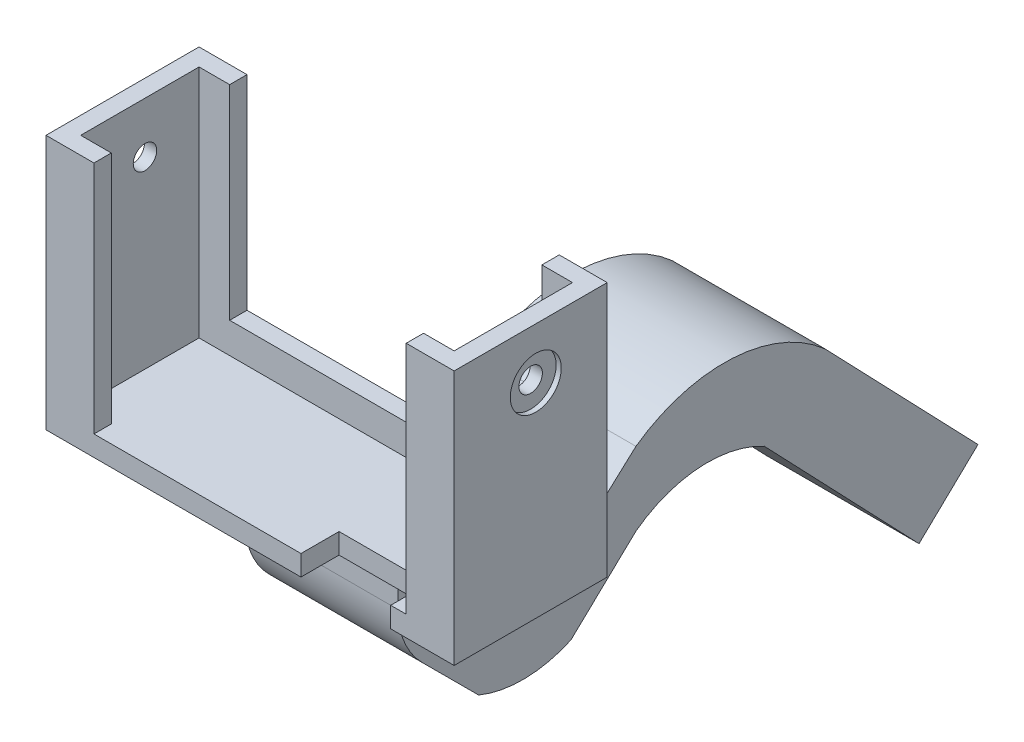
from build123d import *

# Parameters (mm, degrees)
SKETCH_1_W          = 15
SKETCH_1_H          = 8
EXTRUDE_1_DEPTH     = 7
SKETCH_4_W          = 40
SKETCH_4_H          = 15
EXTRUDE_3_DEPTH     = 2
SKETCH_5_W          = 40
SKETCH_5_H          = 15
SKETCH_5_W_2        = 36.6
SKETCH_5_H_2        = 11.6
EXTRUDE_4_DEPTH     = 23
SKETCH_6_W          = 30.6
SKETCH_6_H          = 20
CUT_EXTRUDE_1_DEPTH = 40.05124838
CUT_EXTRUDE_2_REACH = 41.051
SKETCH_7_W          = 30.6
SKETCH_7_H          = 3
CUT_EXTRUDE_3_REACH = 53.196
SKETCH_8_R          = 1.15
SKETCH_9_R          = 2.5
CUT_EXTRUDE_4_DEPTH = 0.5
EXTRUDE_6_DEPTH     = 15
SKETCH_12_W         = 8.790526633
SKETCH_12_H         = 3.731477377
CUT_EXTRUDE_5_DEPTH = 10
SKETCH_13_R         = 3.5
CUT_EXTRUDE_6_DEPTH = 10


with BuildPart() as part:
    # Sketch 1 → Extrude 1 (new body)
    with BuildSketch(Plane(origin=(0, 0, 0), x_dir=(1, 0, 0), z_dir=(0, 1, 0))):
        Rectangle(SKETCH_1_W, SKETCH_1_H)
    extrude(amount=EXTRUDE_1_DEPTH)

    # Sketch 4 → Extrude 3 (add)
    with BuildSketch(Plane(origin=(0, 7, 0), x_dir=(1, 0, 0), z_dir=(0, 1, 0))):
        with Locations((0, -3.5)):
            Rectangle(SKETCH_4_W, SKETCH_4_H)
    extrude(amount=-EXTRUDE_3_DEPTH)

    # Sketch 5 → Extrude 4 (add)
    with BuildSketch(Plane(origin=(0, 7, 0), x_dir=(1, 0, 0), z_dir=(0, 1, 0))):
        with Locations((0, -3.5)):
            Rectangle(SKETCH_5_W, SKETCH_5_H)
        with Locations((0, -3.5)):
            Rectangle(SKETCH_5_W_2, SKETCH_5_H_2, mode=Mode.SUBTRACT)
    extrude(amount=EXTRUDE_4_DEPTH)

    # Sketch 6 → Cut-Extrude 1 (cut, through all)
    with BuildSketch(Plane(origin=(0, 0, -4), x_dir=(-1, 0, 0), z_dir=(0, 0, -1))):
        with Locations((0, 20)):
            Rectangle(SKETCH_6_W, SKETCH_6_H)
    extrude(amount=-CUT_EXTRUDE_1_DEPTH, mode=Mode.SUBTRACT)

    # Sketch 7 → Cut-Extrude 2 (cut, up to next)
    with BuildSketch(Plane.XY.offset(11), mode=Mode.PRIVATE) as cut_extrude_2_sk1:
        with Locations((0, 8.5)):
            Rectangle(SKETCH_7_W, SKETCH_7_H)
    cut_extrude_2_tool1 = extrude(cut_extrude_2_sk1.sketch, amount=-CUT_EXTRUDE_2_REACH, mode=Mode.PRIVATE) & part.part
    add(cut_extrude_2_tool1.solids().sort_by_distance((0, 8.5, 11))[0], mode=Mode.SUBTRACT)

    # Sketch 8 → Cut-Extrude 3 (cut, up to next)
    with BuildSketch(Plane.ZY.offset(20), mode=Mode.PRIVATE) as cut_extrude_3_sk1:
        with Locations((3, 25)):
            Circle(SKETCH_8_R)
    cut_extrude_3_tool1 = extrude(cut_extrude_3_sk1.sketch, amount=-CUT_EXTRUDE_3_REACH, mode=Mode.PRIVATE) & part.part
    cut_extrude_3 = cut_extrude_3_tool1.solids().sort_by_distance((-20, 25, 3))[0]
    add(cut_extrude_3, mode=Mode.SUBTRACT)

    # Sketch 9 → Cut-Extrude 4 (cut)
    with BuildSketch(Plane.ZY.offset(20)):
        with Locations((3, 25)):
            Circle(SKETCH_9_R)
    cut_extrude_4 = extrude(amount=-CUT_EXTRUDE_4_DEPTH, mode=Mode.SUBTRACT)

    # Mirror 2: Cut-Extrude 3, Cut-Extrude 4 across plane
    add(cut_extrude_3.mirror(Plane(origin=(0, 0, 0), x_dir=(0, 0, 1), z_dir=(1, 0, 0))), mode=Mode.SUBTRACT)
    add(cut_extrude_4.mirror(Plane(origin=(0, 0, 0), x_dir=(0, 0, 1), z_dir=(1, 0, 0))), mode=Mode.SUBTRACT)

    # Sketch 11 → Extrude 6 (add)
    with BuildSketch(Plane.ZY.offset(7.5)):
        with BuildLine():
            Line((4, 0), (-4, 0))
            Line((-4, 0), (-7.239161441, -3.14840179))
            ThreePointArc((-7.239161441, -3.14840179), (-10.037611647, -4.034909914), (-12.943816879, -3.621157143))
            Line((-12.943816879, -3.621157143), (-19.318031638, 2.193232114))
            ThreePointArc((-19.318031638, 2.193232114), (-28.760456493, 4.934987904), (-37.853323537, 1.193814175))
            Line((-37.853323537, 1.193814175), (-52.841563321, -14.412413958))
            Line((-52.841563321, -14.412413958), (-47.060181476, -19.9419369))
            Line((-47.060181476, -19.9419369), (-31.90133641, -4.092636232))
            ThreePointArc((-31.90133641, -4.092636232), (-25.47665663, -2.712821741), (-19.318031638, -5.004488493))
            Line((-19.318031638, -5.004488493), (-12.943816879, -11.059496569))
            ThreePointArc((-12.943816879, -11.059496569), (-8.440276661, -12.075753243), (-3.904644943, -11.213954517))
            Line((-3.904644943, -11.213954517), (1.656854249, -5.656854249))
            ThreePointArc((1.656854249, -5.656854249), (3.39103626, -3.061467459), (4, 0))
        make_face()
    extrude(amount=-EXTRUDE_6_DEPTH)

    # Sketch 12 → Cut-Extrude 5 (cut)
    with BuildSketch(Plane(origin=(0, 7, 0), x_dir=(1, 0, 0), z_dir=(0, 1, 0))):
        with Locations((9.385265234, -9.134261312)):
            Rectangle(SKETCH_12_W, SKETCH_12_H)
    extrude(amount=-CUT_EXTRUDE_5_DEPTH, mode=Mode.SUBTRACT)

    # Sketch 13 → Cut-Extrude 6 (cut)
    with BuildSketch(Plane(origin=(0, -8.421208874, -7.681602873), x_dir=(1, 0, 0), z_dir=(0, 0.7388054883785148, 0.6739187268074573))):
        with Locations(Location((0, 11.004242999, 0), (0, 0, 270))):
            Circle(SKETCH_13_R)
    extrude(amount=-CUT_EXTRUDE_6_DEPTH, mode=Mode.SUBTRACT)


solid = part.part
